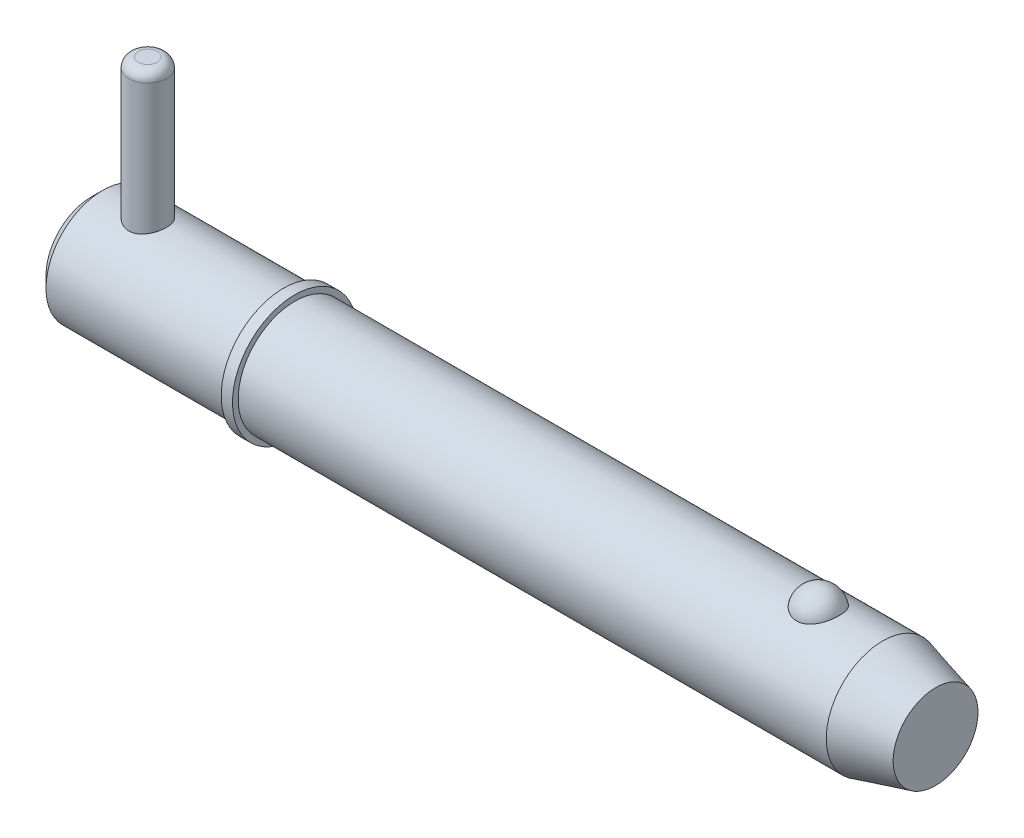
ISO-10303-21;
HEADER;
FILE_DESCRIPTION(('STEP AP214'),'2;1');
FILE_NAME('part.step','',(''),(''),'','','');
FILE_SCHEMA(('AUTOMOTIVE_DESIGN { 1 0 10303 214 1 1 1 1 }'));
ENDSEC;
DATA;
#1=APPLICATION_CONTEXT('core data for automotive mechanical design processes');
#2=APPLICATION_PROTOCOL_DEFINITION('international standard','automotive_design',2000,#1);
#3=PRODUCT_CONTEXT('',#1,'mechanical');
#4=PRODUCT('Part','Part','',(#3));
#5=PRODUCT_RELATED_PRODUCT_CATEGORY('part','',(#4));
#6=PRODUCT_DEFINITION_FORMATION('','',#4);
#7=PRODUCT_DEFINITION_CONTEXT('part definition',#1,'design');
#8=PRODUCT_DEFINITION('design','',#6,#7);
#9=PRODUCT_DEFINITION_SHAPE('','',#8);
#10=(LENGTH_UNIT() NAMED_UNIT(*) SI_UNIT(.MILLI.,.METRE.));
#11=(NAMED_UNIT(*) PLANE_ANGLE_UNIT() SI_UNIT($,.RADIAN.));
#12=(NAMED_UNIT(*) SI_UNIT($,.STERADIAN.) SOLID_ANGLE_UNIT());
#13=UNCERTAINTY_MEASURE_WITH_UNIT(LENGTH_MEASURE(1.E-05),#10,'distance_accuracy_value','');
#14=(GEOMETRIC_REPRESENTATION_CONTEXT(3) GLOBAL_UNCERTAINTY_ASSIGNED_CONTEXT((#13)) GLOBAL_UNIT_ASSIGNED_CONTEXT((#10,
#11,#12)) REPRESENTATION_CONTEXT('',''));
#15=CARTESIAN_POINT('',(0.,0.,0.));
#16=DIRECTION('',(0.,0.,1.));
#17=DIRECTION('',(1.,0.,0.));
#18=AXIS2_PLACEMENT_3D('',#15,#16,#17);
#19=CARTESIAN_POINT('',(7.14,24.605,0.));
#20=DIRECTION('',(0.,-1.,0.));
#21=DIRECTION('',(0.,0.,-1.));
#22=AXIS2_PLACEMENT_3D('',#19,#20,#21);
#23=CYLINDRICAL_SURFACE('',#22,2.38);
#24=CARTESIAN_POINT('',(7.14,-5.955,0.));
#25=DIRECTION('',(0.,1.,0.));
#26=DIRECTION('',(0.,0.,1.));
#27=AXIS2_PLACEMENT_3D('',#24,#25,#26);
#28=CIRCLE('',#27,2.38);
#29=CARTESIAN_POINT('',(7.14,-5.955,2.38));
#30=VERTEX_POINT('',#29);
#31=EDGE_CURVE('P0_E25',#30,#30,#28,.T.);
#32=ORIENTED_EDGE('',*,*,#31,.T.);
#33=EDGE_LOOP('',(#32));
#34=FACE_BOUND('',#33,.T.);
#35=CARTESIAN_POINT('',(7.14,23.415,0.));
#36=DIRECTION('',(0.,1.,0.));
#37=DIRECTION('',(0.,0.,1.));
#38=AXIS2_PLACEMENT_3D('',#35,#36,#37);
#39=CIRCLE('',#38,2.38);
#40=CARTESIAN_POINT('',(7.14,23.415,2.38));
#41=VERTEX_POINT('',#40);
#42=EDGE_CURVE('P0_E29',#41,#41,#39,.F.);
#43=ORIENTED_EDGE('',*,*,#42,.T.);
#44=EDGE_LOOP('',(#43));
#45=FACE_BOUND('',#44,.T.);
#46=ADVANCED_FACE('P0_F14',(#34,#45),#23,.T.);
#47=CARTESIAN_POINT('',(7.14,24.605,0.));
#48=DIRECTION('',(0.,1.,0.));
#49=DIRECTION('',(0.,0.,1.));
#50=AXIS2_PLACEMENT_3D('',#47,#48,#49);
#51=PLANE('',#50);
#52=CARTESIAN_POINT('',(7.14,24.605,0.));
#53=DIRECTION('',(0.,1.,0.));
#54=DIRECTION('',(0.,0.,1.));
#55=AXIS2_PLACEMENT_3D('',#52,#53,#54);
#56=CIRCLE('',#55,1.19);
#57=CARTESIAN_POINT('',(7.14,24.605,1.19));
#58=VERTEX_POINT('',#57);
#59=EDGE_CURVE('P0_E10',#58,#58,#56,.T.);
#60=ORIENTED_EDGE('',*,*,#59,.T.);
#61=EDGE_LOOP('',(#60));
#62=FACE_BOUND('',#61,.T.);
#63=ADVANCED_FACE('P0_F46',(#62),#51,.T.);
#64=CARTESIAN_POINT('',(7.14,-7.145,0.));
#65=DIRECTION('',(0.,1.,0.));
#66=DIRECTION('',(0.,0.,1.));
#67=AXIS2_PLACEMENT_3D('',#64,#65,#66);
#68=PLANE('',#67);
#69=CARTESIAN_POINT('',(7.14,-7.145,0.));
#70=DIRECTION('',(0.,1.,0.));
#71=DIRECTION('',(0.,0.,1.));
#72=AXIS2_PLACEMENT_3D('',#69,#70,#71);
#73=CIRCLE('',#72,1.19);
#74=CARTESIAN_POINT('',(7.14,-7.145,1.19));
#75=VERTEX_POINT('',#74);
#76=EDGE_CURVE('P0_E21',#75,#75,#73,.F.);
#77=ORIENTED_EDGE('',*,*,#76,.T.);
#78=EDGE_LOOP('',(#77));
#79=FACE_BOUND('',#78,.T.);
#80=ADVANCED_FACE('P0_F43',(#79),#68,.F.);
#81=CARTESIAN_POINT('',(7.14,-5.955,0.));
#82=DIRECTION('',(0.,1.,0.));
#83=DIRECTION('',(0.,0.,1.));
#84=AXIS2_PLACEMENT_3D('',#81,#82,#83);
#85=DEGENERATE_TOROIDAL_SURFACE('',#84,1.19,1.19,.T.);
#86=ORIENTED_EDGE('',*,*,#76,.F.);
#87=EDGE_LOOP('',(#86));
#88=FACE_BOUND('',#87,.T.);
#89=ORIENTED_EDGE('',*,*,#31,.F.);
#90=EDGE_LOOP('',(#89));
#91=FACE_BOUND('',#90,.T.);
#92=ADVANCED_FACE('P0_F38',(#88,#91),#85,.T.);
#93=CARTESIAN_POINT('',(7.14,23.415,0.));
#94=DIRECTION('',(0.,1.,0.));
#95=DIRECTION('',(0.,0.,1.));
#96=AXIS2_PLACEMENT_3D('',#93,#94,#95);
#97=DEGENERATE_TOROIDAL_SURFACE('',#96,1.19,1.19,.T.);
#98=ORIENTED_EDGE('',*,*,#42,.F.);
#99=EDGE_LOOP('',(#98));
#100=FACE_BOUND('',#99,.T.);
#101=ORIENTED_EDGE('',*,*,#59,.F.);
#102=EDGE_LOOP('',(#101));
#103=FACE_BOUND('',#102,.T.);
#104=ADVANCED_FACE('P0_F16',(#100,#103),#97,.T.);
#105=CLOSED_SHELL('',(#46,#63,#80,#92,#104));
#106=MANIFOLD_SOLID_BREP('P0_B1',#105);
#107=CARTESIAN_POINT('',(0.,0.,0.));
#108=DIRECTION('',(1.,0.,0.));
#109=DIRECTION('',(0.,0.,-1.));
#110=AXIS2_PLACEMENT_3D('',#107,#108,#109);
#111=CYLINDRICAL_SURFACE('',#110,7.145);
#112=CARTESIAN_POINT('',(99.9836242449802,0.,0.));
#113=DIRECTION('',(1.,0.,0.));
#114=DIRECTION('',(0.,0.,-1.));
#115=AXIS2_PLACEMENT_3D('',#112,#113,#114);
#116=CIRCLE('',#115,7.145);
#117=CARTESIAN_POINT('',(99.9836242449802,0.,-7.145));
#118=VERTEX_POINT('',#117);
#119=EDGE_CURVE('P1_E81',#118,#118,#116,.T.);
#120=ORIENTED_EDGE('',*,*,#119,.F.);
#121=EDGE_LOOP('',(#120));
#122=FACE_BOUND('',#121,.T.);
#123=CARTESIAN_POINT('',(25.7,0.,0.));
#124=DIRECTION('',(1.,0.,0.));
#125=DIRECTION('',(0.,0.,-1.));
#126=AXIS2_PLACEMENT_3D('',#123,#124,#125);
#127=CIRCLE('',#126,7.145);
#128=CARTESIAN_POINT('',(25.7,0.,-7.145));
#129=VERTEX_POINT('',#128);
#130=EDGE_CURVE('P1_E85',#129,#129,#127,.T.);
#131=ORIENTED_EDGE('',*,*,#130,.T.);
#132=EDGE_LOOP('',(#131));
#133=FACE_BOUND('',#132,.T.);
#134=CARTESIAN_POINT('',(91.8395037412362,6.60328629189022,2.72903557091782));
#135=CARTESIAN_POINT('',(91.6983158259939,6.60329644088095,2.72902496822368));
#136=CARTESIAN_POINT('',(91.5568832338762,6.60799490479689,2.71772840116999));
#137=CARTESIAN_POINT('',(91.2779557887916,6.62628236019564,2.67281935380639));
#138=CARTESIAN_POINT('',(91.1404726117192,6.63989534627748,2.63914664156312));
#139=CARTESIAN_POINT('',(90.8738894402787,6.67440775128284,2.55059642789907));
#140=CARTESIAN_POINT('',(90.7447683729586,6.69528793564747,2.49577486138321));
#141=CARTESIAN_POINT('',(90.4978694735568,6.74205585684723,2.36651799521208));
#142=CARTESIAN_POINT('',(90.3800865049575,6.76794130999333,2.29209163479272));
#143=CARTESIAN_POINT('',(90.1551671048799,6.82286177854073,2.12312937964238));
#144=CARTESIAN_POINT('',(90.0484405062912,6.85196655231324,2.02807107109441));
#145=CARTESIAN_POINT('',(89.8519181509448,6.90970232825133,1.82167822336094));
#146=CARTESIAN_POINT('',(89.7621276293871,6.93833318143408,1.71033867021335));
#147=CARTESIAN_POINT('',(89.5976670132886,6.9935167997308,1.46891951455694));
#148=CARTESIAN_POINT('',(89.523844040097,7.01992110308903,1.33822781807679));
#149=CARTESIAN_POINT('',(89.3980884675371,7.06643385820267,1.0656656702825));
#150=CARTESIAN_POINT('',(89.3461573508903,7.08654188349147,0.923794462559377));
#151=CARTESIAN_POINT('',(89.2647323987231,7.11862399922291,0.630993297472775));
#152=CARTESIAN_POINT('',(89.2355167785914,7.13049704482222,0.479974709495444));
#153=CARTESIAN_POINT('',(89.2011742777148,7.14449484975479,0.174782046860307));
#154=CARTESIAN_POINT('',(89.1960466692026,7.14661990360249,0.0206080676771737));
#155=CARTESIAN_POINT('',(89.209938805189,7.14092465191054,-0.285506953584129));
#156=CARTESIAN_POINT('',(89.2288101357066,7.1331654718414,-0.437455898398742));
#157=CARTESIAN_POINT('',(89.2900622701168,7.10859076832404,-0.735778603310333));
#158=CARTESIAN_POINT('',(89.3324435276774,7.0917750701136,-0.882152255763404));
#159=CARTESIAN_POINT('',(89.4399346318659,7.05076716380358,-1.16543149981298));
#160=CARTESIAN_POINT('',(89.5050759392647,7.02656475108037,-1.30232366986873));
#161=CARTESIAN_POINT('',(89.6567597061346,6.97329145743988,-1.56265907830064));
#162=CARTESIAN_POINT('',(89.743303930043,6.94422017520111,-1.68610120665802));
#163=CARTESIAN_POINT('',(89.9364654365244,6.88415108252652,-1.91671004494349));
#164=CARTESIAN_POINT('',(90.0431807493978,6.85314438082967,-2.02379244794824));
#165=CARTESIAN_POINT('',(90.2739740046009,6.79282069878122,-2.21787433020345));
#166=CARTESIAN_POINT('',(90.3980505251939,6.76350358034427,-2.30487545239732));
#167=CARTESIAN_POINT('',(90.6576784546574,6.7106058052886,-2.45458647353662));
#168=CARTESIAN_POINT('',(90.7929387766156,6.68691885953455,-2.5177624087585));
#169=CARTESIAN_POINT('',(91.0732778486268,6.64741247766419,-2.62030218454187));
#170=CARTESIAN_POINT('',(91.218352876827,6.63159007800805,-2.65967499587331));
#171=CARTESIAN_POINT('',(91.5063475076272,6.61038594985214,-2.71193301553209));
#172=CARTESIAN_POINT('',(91.6490080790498,6.60451880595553,-2.72605165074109));
#173=CARTESIAN_POINT('',(91.9348004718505,6.60240611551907,-2.73116688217));
#174=CARTESIAN_POINT('',(92.0779321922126,6.60615862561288,-2.72216814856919));
#175=CARTESIAN_POINT('',(92.3558486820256,6.6225609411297,-2.68200435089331));
#176=CARTESIAN_POINT('',(92.4907542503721,6.63492533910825,-2.65154998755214));
#177=CARTESIAN_POINT('',(92.75332009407,6.66687445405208,-2.57015684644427));
#178=CARTESIAN_POINT('',(92.8809797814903,6.68645975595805,-2.51921640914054));
#179=CARTESIAN_POINT('',(93.1285777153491,6.73127274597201,-2.39693610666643));
#180=CARTESIAN_POINT('',(93.2482878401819,6.7566138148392,-2.32517694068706));
#181=CARTESIAN_POINT('',(93.4741592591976,6.8100600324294,-2.1636381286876));
#182=CARTESIAN_POINT('',(93.580317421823,6.83816581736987,-2.07385432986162));
#183=CARTESIAN_POINT('',(93.7818620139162,6.89580469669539,-1.87357235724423));
#184=CARTESIAN_POINT('',(93.876440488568,6.92533863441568,-1.76226074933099));
#185=CARTESIAN_POINT('',(94.0463329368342,6.98139526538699,-1.52511696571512));
#186=CARTESIAN_POINT('',(94.1216434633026,7.0079174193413,-1.39928219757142));
#187=CARTESIAN_POINT('',(94.253595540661,7.05607625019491,-1.1321597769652));
#188=CARTESIAN_POINT('',(94.3095688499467,7.07753119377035,-0.990508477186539));
#189=CARTESIAN_POINT('',(94.3982965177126,7.11222355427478,-0.699154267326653));
#190=CARTESIAN_POINT('',(94.4310506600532,7.12546089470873,-0.549451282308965));
#191=CARTESIAN_POINT('',(94.4726899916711,7.1423758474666,-0.246120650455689));
#192=CARTESIAN_POINT('',(94.481558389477,7.14604673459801,-0.0924903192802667));
#193=CARTESIAN_POINT('',(94.4751940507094,7.14343510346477,0.214181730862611));
#194=CARTESIAN_POINT('',(94.4599618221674,7.13715279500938,0.367223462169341));
#195=CARTESIAN_POINT('',(94.4058451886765,7.11532948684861,0.667595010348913));
#196=CARTESIAN_POINT('',(94.3670776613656,7.09983424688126,0.814949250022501));
#197=CARTESIAN_POINT('',(94.2667700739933,7.06119140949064,1.10063221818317));
#198=CARTESIAN_POINT('',(94.2052284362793,7.03804328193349,1.23896032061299));
#199=CARTESIAN_POINT('',(94.0602071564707,6.98632429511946,1.5035230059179));
#200=CARTESIAN_POINT('',(93.9766067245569,6.95772382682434,1.62968561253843));
#201=CARTESIAN_POINT('',(93.7893804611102,6.89823072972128,1.865543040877));
#202=CARTESIAN_POINT('',(93.6857557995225,6.86733823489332,1.9752388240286));
#203=CARTESIAN_POINT('',(93.4610769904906,6.80676456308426,2.17482293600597));
#204=CARTESIAN_POINT('',(93.3400673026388,6.77708053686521,2.26476035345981));
#205=CARTESIAN_POINT('',(93.0833408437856,6.7223050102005,2.42252989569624));
#206=CARTESIAN_POINT('',(92.94761851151,6.69721525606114,2.49035362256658));
#207=CARTESIAN_POINT('',(92.6704022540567,6.65552591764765,2.59967646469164));
#208=CARTESIAN_POINT('',(92.5292810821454,6.63865794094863,2.64202017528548));
#209=CARTESIAN_POINT('',(92.2414448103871,6.61425039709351,2.70255841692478));
#210=CARTESIAN_POINT('',(92.0947480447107,6.60668259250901,2.720826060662));
#211=CARTESIAN_POINT('',(91.9116799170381,6.60358754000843,2.72830331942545));
#212=CARTESIAN_POINT('',(91.8755998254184,6.60328369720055,2.72903828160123));
#213=CARTESIAN_POINT('',(91.8395037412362,6.60328629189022,2.72903557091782));
#214=B_SPLINE_CURVE_WITH_KNOTS('',3,(#134,#135,#136,#137,#138,#139,#140,#141,#142,#143,#144,
#145,#146,#147,#148,#149,#150,#151,#152,#153,#154,#155,#156,#157,#158,#159,#160,#161,#162,#163,
#164,#165,#166,#167,#168,#169,#170,#171,#172,#173,#174,#175,#176,#177,#178,#179,#180,#181,#182,
#183,#184,#185,#186,#187,#188,#189,#190,#191,#192,#193,#194,#195,#196,#197,#198,#199,#200,#201,
#202,#203,#204,#205,#206,#207,#208,#209,#210,#211,#212,#213),.UNSPECIFIED.,.T.,.F.,(4,2,2,2,2,2,
2,2,2,2,2,2,2,2,2,2,2,2,2,2,2,2,2,2,2,2,2,2,2,2,2,2,2,2,2,2,2,2,2,4),(0.,0.423468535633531,
0.848081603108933,1.27157926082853,1.69488414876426,2.13051395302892,2.56627819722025,
3.0213670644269,3.47648674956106,3.93709649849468,4.39769233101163,4.85545355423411,
5.31322361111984,5.77162895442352,6.23007210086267,6.69080337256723,7.15149693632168,
7.60264329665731,8.05361952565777,8.48189729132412,8.91008854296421,9.32472524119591,
9.73939553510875,10.1630783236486,10.5868588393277,11.0319070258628,11.4770347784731,
11.9362874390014,12.3955443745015,12.855124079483,13.3146940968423,13.7720003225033,
14.2293382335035,14.6892343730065,15.1491036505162,15.6078171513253,16.0667046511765,
16.5093965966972,16.9507410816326,17.059004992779),.UNSPECIFIED.);
#215=CARTESIAN_POINT('',(91.8395037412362,6.60328629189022,2.72903557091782));
#216=VERTEX_POINT('',#215);
#217=EDGE_CURVE('P1_E35',#216,#216,#214,.T.);
#218=ORIENTED_EDGE('',*,*,#217,.T.);
#219=EDGE_LOOP('',(#218));
#220=FACE_BOUND('',#219,.T.);
#221=ADVANCED_FACE('P1_F13',(#122,#133,#220),#111,.T.);
#222=CARTESIAN_POINT('',(0.,0.,0.));
#223=DIRECTION('',(-1.,0.,0.));
#224=DIRECTION('',(0.,0.,1.));
#225=AXIS2_PLACEMENT_3D('',#222,#223,#224);
#226=PLANE('',#225);
#227=CARTESIAN_POINT('',(0.,0.,0.));
#228=DIRECTION('',(1.,0.,0.));
#229=DIRECTION('',(0.,0.,-1.));
#230=AXIS2_PLACEMENT_3D('',#227,#228,#229);
#231=CIRCLE('',#230,5.716);
#232=CARTESIAN_POINT('',(0.,0.,-5.716));
#233=VERTEX_POINT('',#232);
#234=EDGE_CURVE('P1_E9',#233,#233,#231,.T.);
#235=ORIENTED_EDGE('',*,*,#234,.F.);
#236=EDGE_LOOP('',(#235));
#237=FACE_BOUND('',#236,.T.);
#238=ADVANCED_FACE('P1_F15',(#237),#226,.T.);
#239=CARTESIAN_POINT('',(1.42899999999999,0.,0.));
#240=DIRECTION('',(1.,0.,0.));
#241=DIRECTION('',(0.,0.,-1.));
#242=AXIS2_PLACEMENT_3D('',#239,#240,#241);
#243=CONICAL_SURFACE('',#242,7.145,0.78539816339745);
#244=ORIENTED_EDGE('',*,*,#234,.T.);
#245=EDGE_LOOP('',(#244));
#246=FACE_BOUND('',#245,.T.);
#247=CARTESIAN_POINT('',(1.42899999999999,0.,0.));
#248=DIRECTION('',(1.,0.,0.));
#249=DIRECTION('',(0.,0.,-1.));
#250=AXIS2_PLACEMENT_3D('',#247,#248,#249);
#251=CIRCLE('',#250,7.145);
#252=CARTESIAN_POINT('',(1.42899999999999,0.,-7.145));
#253=VERTEX_POINT('',#252);
#254=EDGE_CURVE('P1_E26',#253,#253,#251,.T.);
#255=ORIENTED_EDGE('',*,*,#254,.F.);
#256=EDGE_LOOP('',(#255));
#257=FACE_BOUND('',#256,.T.);
#258=ADVANCED_FACE('P1_F77',(#246,#257),#243,.T.);
#259=CARTESIAN_POINT('',(0.,0.,0.));
#260=DIRECTION('',(1.,0.,0.));
#261=DIRECTION('',(0.,0.,-1.));
#262=AXIS2_PLACEMENT_3D('',#259,#260,#261);
#263=CYLINDRICAL_SURFACE('',#262,7.145);
#264=CARTESIAN_POINT('',(7.14,-6.73695962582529,2.38));
#265=CARTESIAN_POINT('',(7.01035997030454,-6.73695921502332,2.38000059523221));
#266=CARTESIAN_POINT('',(6.88072348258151,-6.74074253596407,2.36937183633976));
#267=CARTESIAN_POINT('',(6.62529075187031,-6.75538853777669,2.32728080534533));
#268=CARTESIAN_POINT('',(6.49949514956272,-6.76625239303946,2.29581507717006));
#269=CARTESIAN_POINT('',(6.2554858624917,-6.79369535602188,2.21327763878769));
#270=CARTESIAN_POINT('',(6.13725786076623,-6.81026326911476,2.16224430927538));
#271=CARTESIAN_POINT('',(5.91100349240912,-6.84723128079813,2.04215132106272));
#272=CARTESIAN_POINT('',(5.80297937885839,-6.86763222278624,1.97308769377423));
#273=CARTESIAN_POINT('',(5.59597854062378,-6.91086152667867,1.81600414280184));
#274=CARTESIAN_POINT('',(5.49745861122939,-6.93375032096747,1.72739874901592));
#275=CARTESIAN_POINT('',(5.31636508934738,-6.97886546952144,1.53499636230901));
#276=CARTESIAN_POINT('',(5.23379405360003,-7.00109171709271,1.43119693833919));
#277=CARTESIAN_POINT('',(5.08487013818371,-7.04307708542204,1.20801318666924));
#278=CARTESIAN_POINT('',(5.01899578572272,-7.06275685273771,1.08829330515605));
#279=CARTESIAN_POINT('',(4.90850130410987,-7.09671988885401,0.838703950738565));
#280=CARTESIAN_POINT('',(4.86387545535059,-7.11100460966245,0.70883722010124));
#281=CARTESIAN_POINT('',(4.79869354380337,-7.13213998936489,0.44742990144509));
#282=CARTESIAN_POINT('',(4.77735497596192,-7.13923172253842,0.316104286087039));
#283=CARTESIAN_POINT('',(4.75686536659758,-7.14603777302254,0.0515578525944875));
#284=CARTESIAN_POINT('',(4.75770861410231,-7.14575398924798,-0.0816624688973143));
#285=CARTESIAN_POINT('',(4.78106216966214,-7.13800438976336,-0.340678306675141));
#286=CARTESIAN_POINT('',(4.80272255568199,-7.13082030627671,-0.466560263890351));
#287=CARTESIAN_POINT('',(4.86569013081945,-7.11043095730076,-0.712788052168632));
#288=CARTESIAN_POINT('',(4.90699865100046,-7.09722528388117,-0.833133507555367));
#289=CARTESIAN_POINT('',(5.00858673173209,-7.06591754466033,-1.06673173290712));
#290=CARTESIAN_POINT('',(5.06910834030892,-7.0477534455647,-1.17987058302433));
#291=CARTESIAN_POINT('',(5.20720514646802,-7.00841977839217,-1.39463797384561));
#292=CARTESIAN_POINT('',(5.28478508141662,-6.987249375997,-1.49626330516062));
#293=CARTESIAN_POINT('',(5.4590800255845,-6.94296010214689,-1.69017445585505));
#294=CARTESIAN_POINT('',(5.55652324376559,-6.91979641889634,-1.78179645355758));
#295=CARTESIAN_POINT('',(5.76558873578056,-6.87497076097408,-1.94761348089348));
#296=CARTESIAN_POINT('',(5.87721318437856,-6.85330901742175,-2.02180583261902));
#297=CARTESIAN_POINT('',(6.11357367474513,-6.81369485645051,-2.15157488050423));
#298=CARTESIAN_POINT('',(6.23847358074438,-6.79579956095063,-2.20687188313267));
#299=CARTESIAN_POINT('',(6.49655785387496,-6.76640630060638,-2.29542443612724));
#300=CARTESIAN_POINT('',(6.62973872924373,-6.75490565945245,-2.32868920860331));
#301=CARTESIAN_POINT('',(6.89417536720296,-6.74020933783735,-2.37088225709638));
#302=CARTESIAN_POINT('',(7.02524746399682,-6.73666278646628,-2.38083959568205));
#303=CARTESIAN_POINT('',(7.28721035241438,-6.73729555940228,-2.37904974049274));
#304=CARTESIAN_POINT('',(7.41810117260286,-6.7414734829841,-2.36730648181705));
#305=CARTESIAN_POINT('',(7.67130717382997,-6.75673471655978,-2.32337336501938));
#306=CARTESIAN_POINT('',(7.79376251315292,-6.76757635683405,-2.29189834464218));
#307=CARTESIAN_POINT('',(8.03162917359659,-6.79467771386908,-2.21025275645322));
#308=CARTESIAN_POINT('',(8.14703924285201,-6.8109383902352,-2.16007887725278));
#309=CARTESIAN_POINT('',(8.37159169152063,-6.84768362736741,-2.04065289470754));
#310=CARTESIAN_POINT('',(8.48041962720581,-6.86828569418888,-1.97084668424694));
#311=CARTESIAN_POINT('',(8.68518919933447,-6.91116416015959,-1.8147657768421));
#312=CARTESIAN_POINT('',(8.78112702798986,-6.93344105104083,-1.72848623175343));
#313=CARTESIAN_POINT('',(8.96215574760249,-6.97845348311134,-1.53698616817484));
#314=CARTESIAN_POINT('',(9.04650427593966,-7.00115965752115,-1.43105491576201));
#315=CARTESIAN_POINT('',(9.19627592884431,-7.04341676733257,-1.20598377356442));
#316=CARTESIAN_POINT('',(9.26169972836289,-7.06296781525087,-1.08684435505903));
#317=CARTESIAN_POINT('',(9.37116617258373,-7.0966205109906,-0.83933303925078));
#318=CARTESIAN_POINT('',(9.41534821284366,-7.11075755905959,-0.711027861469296));
#319=CARTESIAN_POINT('',(9.48132660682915,-7.13214194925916,-0.448245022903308));
#320=CARTESIAN_POINT('',(9.50313102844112,-7.13939177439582,-0.313769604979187));
#321=CARTESIAN_POINT('',(9.5230098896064,-7.14599771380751,-0.049254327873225));
#322=CARTESIAN_POINT('',(9.52215013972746,-7.14570837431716,0.0806974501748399));
#323=CARTESIAN_POINT('',(9.49935359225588,-7.13814116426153,0.338518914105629));
#324=CARTESIAN_POINT('',(9.47741850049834,-7.13086385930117,0.466388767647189));
#325=CARTESIAN_POINT('',(9.4138005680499,-7.11026814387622,0.714400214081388));
#326=CARTESIAN_POINT('',(9.37243609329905,-7.09704726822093,0.834632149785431));
#327=CARTESIAN_POINT('',(9.27142829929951,-7.06592602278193,1.06649582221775));
#328=CARTESIAN_POINT('',(9.2117816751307,-7.04802480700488,1.1781259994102));
#329=CARTESIAN_POINT('',(9.07336776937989,-7.00856499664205,1.39411030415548));
#330=CARTESIAN_POINT('',(8.99397590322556,-6.98689577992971,1.49804368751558));
#331=CARTESIAN_POINT('',(8.81938810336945,-6.9426110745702,1.69146078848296));
#332=CARTESIAN_POINT('',(8.72418713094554,-6.91999528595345,1.78093988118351));
#333=CARTESIAN_POINT('',(8.51623540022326,-6.87531507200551,1.94646188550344));
#334=CARTESIAN_POINT('',(8.4029442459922,-6.85330672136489,2.02184316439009));
#335=CARTESIAN_POINT('',(8.16461714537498,-6.81342065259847,2.1524427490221));
#336=CARTESIAN_POINT('',(8.03958429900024,-6.7955418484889,2.20766635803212));
#337=CARTESIAN_POINT('',(7.78712566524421,-6.76686117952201,2.29403636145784));
#338=CARTESIAN_POINT('',(7.66006989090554,-6.75577342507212,2.32616709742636));
#339=CARTESIAN_POINT('',(7.40200728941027,-6.74082409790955,2.36914495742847));
#340=CARTESIAN_POINT('',(7.27100183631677,-6.73696004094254,2.37999939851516));
#341=CARTESIAN_POINT('',(7.14,-6.73695962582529,2.38));
#342=B_SPLINE_CURVE_WITH_KNOTS('',3,(#264,#265,#266,#267,#268,#269,#270,#271,#272,#273,#274,
#275,#276,#277,#278,#279,#280,#281,#282,#283,#284,#285,#286,#287,#288,#289,#290,#291,#292,#293,
#294,#295,#296,#297,#298,#299,#300,#301,#302,#303,#304,#305,#306,#307,#308,#309,#310,#311,#312,
#313,#314,#315,#316,#317,#318,#319,#320,#321,#322,#323,#324,#325,#326,#327,#328,#329,#330,#331,
#332,#333,#334,#335,#336,#337,#338,#339,#340,#341),.UNSPECIFIED.,.T.,.F.,(4,2,2,2,2,2,2,2,2,2,2,
2,2,2,2,2,2,2,2,2,2,2,2,2,2,2,2,2,2,2,2,2,2,2,2,2,2,2,4),(0.,0.388434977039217,
0.776934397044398,1.16467566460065,1.55250234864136,1.9540847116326,2.35573139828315,
2.76784120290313,3.17984001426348,3.57752248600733,3.97510257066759,4.35711073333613,
4.7391447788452,5.12619663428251,5.51335611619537,5.91871976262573,6.3241456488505,
6.73533623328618,7.14635459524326,7.53885245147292,7.93127914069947,8.31025106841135,
8.68929014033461,9.08033871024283,9.47150254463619,9.88145528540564,10.2913934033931,
10.6986033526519,11.1056664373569,11.4936225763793,11.8815473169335,12.2633262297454,
12.645174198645,13.0411187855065,13.437189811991,13.8487371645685,14.2601761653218,
14.6528265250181,15.0453418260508),.UNSPECIFIED.);
#343=CARTESIAN_POINT('',(7.14,-6.73695962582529,2.38));
#344=VERTEX_POINT('',#343);
#345=EDGE_CURVE('P1_E17',#344,#344,#342,.T.);
#346=ORIENTED_EDGE('',*,*,#345,.F.);
#347=EDGE_LOOP('',(#346));
#348=FACE_BOUND('',#347,.T.);
#349=CARTESIAN_POINT('',(7.14,6.73695962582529,2.38));
#350=CARTESIAN_POINT('',(7.26964002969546,6.73695921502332,2.38000059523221));
#351=CARTESIAN_POINT('',(7.39927651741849,6.74074253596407,2.36937183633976));
#352=CARTESIAN_POINT('',(7.65470924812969,6.75538853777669,2.32728080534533));
#353=CARTESIAN_POINT('',(7.78050485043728,6.76625239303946,2.29581507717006));
#354=CARTESIAN_POINT('',(8.02451413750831,6.79369535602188,2.21327763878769));
#355=CARTESIAN_POINT('',(8.14274213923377,6.81026326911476,2.16224430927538));
#356=CARTESIAN_POINT('',(8.36899650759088,6.84723128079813,2.04215132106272));
#357=CARTESIAN_POINT('',(8.47702062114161,6.86763222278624,1.97308769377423));
#358=CARTESIAN_POINT('',(8.68402145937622,6.91086152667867,1.81600414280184));
#359=CARTESIAN_POINT('',(8.78254138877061,6.93375032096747,1.72739874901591));
#360=CARTESIAN_POINT('',(8.96363491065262,6.97886546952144,1.53499636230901));
#361=CARTESIAN_POINT('',(9.04620594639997,7.00109171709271,1.43119693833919));
#362=CARTESIAN_POINT('',(9.19512986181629,7.04307708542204,1.20801318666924));
#363=CARTESIAN_POINT('',(9.26100421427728,7.06275685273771,1.08829330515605));
#364=CARTESIAN_POINT('',(9.37149869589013,7.09671988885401,0.838703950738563));
#365=CARTESIAN_POINT('',(9.41612454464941,7.11100460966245,0.708837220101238));
#366=CARTESIAN_POINT('',(9.48130645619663,7.13213998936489,0.447429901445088));
#367=CARTESIAN_POINT('',(9.50264502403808,7.13923172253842,0.316104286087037));
#368=CARTESIAN_POINT('',(9.52313463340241,7.14603777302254,0.0515578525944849));
#369=CARTESIAN_POINT('',(9.52229138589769,7.14575398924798,-0.0816624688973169));
#370=CARTESIAN_POINT('',(9.49893783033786,7.13800438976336,-0.340678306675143));
#371=CARTESIAN_POINT('',(9.47727744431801,7.13082030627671,-0.466560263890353));
#372=CARTESIAN_POINT('',(9.41430986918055,7.11043095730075,-0.712788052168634));
#373=CARTESIAN_POINT('',(9.37300134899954,7.09722528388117,-0.833133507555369));
#374=CARTESIAN_POINT('',(9.27141326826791,7.06591754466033,-1.06673173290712));
#375=CARTESIAN_POINT('',(9.21089165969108,7.0477534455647,-1.17987058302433));
#376=CARTESIAN_POINT('',(9.07279485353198,7.00841977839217,-1.39463797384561));
#377=CARTESIAN_POINT('',(8.99521491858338,6.987249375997,-1.49626330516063));
#378=CARTESIAN_POINT('',(8.82091997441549,6.94296010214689,-1.69017445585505));
#379=CARTESIAN_POINT('',(8.72347675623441,6.91979641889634,-1.78179645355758));
#380=CARTESIAN_POINT('',(8.51441126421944,6.87497076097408,-1.94761348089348));
#381=CARTESIAN_POINT('',(8.40278681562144,6.85330901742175,-2.02180583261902));
#382=CARTESIAN_POINT('',(8.16642632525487,6.81369485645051,-2.15157488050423));
#383=CARTESIAN_POINT('',(8.04152641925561,6.79579956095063,-2.20687188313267));
#384=CARTESIAN_POINT('',(7.78344214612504,6.76640630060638,-2.29542443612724));
#385=CARTESIAN_POINT('',(7.65026127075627,6.75490565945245,-2.32868920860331));
#386=CARTESIAN_POINT('',(7.38582463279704,6.74020933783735,-2.37088225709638));
#387=CARTESIAN_POINT('',(7.25475253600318,6.73666278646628,-2.38083959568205));
#388=CARTESIAN_POINT('',(6.99278964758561,6.73729555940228,-2.37904974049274));
#389=CARTESIAN_POINT('',(6.86189882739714,6.7414734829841,-2.36730648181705));
#390=CARTESIAN_POINT('',(6.60869282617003,6.75673471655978,-2.32337336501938));
#391=CARTESIAN_POINT('',(6.48623748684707,6.76757635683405,-2.29189834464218));
#392=CARTESIAN_POINT('',(6.2483708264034,6.79467771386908,-2.21025275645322));
#393=CARTESIAN_POINT('',(6.13296075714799,6.8109383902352,-2.16007887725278));
#394=CARTESIAN_POINT('',(5.90840830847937,6.84768362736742,-2.04065289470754));
#395=CARTESIAN_POINT('',(5.79958037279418,6.86828569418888,-1.97084668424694));
#396=CARTESIAN_POINT('',(5.59481080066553,6.91116416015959,-1.8147657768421));
#397=CARTESIAN_POINT('',(5.49887297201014,6.93344105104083,-1.72848623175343));
#398=CARTESIAN_POINT('',(5.31784425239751,6.97845348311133,-1.53698616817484));
#399=CARTESIAN_POINT('',(5.23349572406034,7.00115965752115,-1.43105491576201));
#400=CARTESIAN_POINT('',(5.08372407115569,7.04341676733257,-1.20598377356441));
#401=CARTESIAN_POINT('',(5.01830027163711,7.06296781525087,-1.08684435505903));
#402=CARTESIAN_POINT('',(4.90883382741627,7.0966205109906,-0.839333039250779));
#403=CARTESIAN_POINT('',(4.86465178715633,7.11075755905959,-0.711027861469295));
#404=CARTESIAN_POINT('',(4.79867339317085,7.13214194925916,-0.448245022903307));
#405=CARTESIAN_POINT('',(4.77686897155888,7.13939177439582,-0.313769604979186));
#406=CARTESIAN_POINT('',(4.7569901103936,7.14599771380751,-0.0492543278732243));
#407=CARTESIAN_POINT('',(4.75784986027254,7.14570837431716,0.0806974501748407));
#408=CARTESIAN_POINT('',(4.78064640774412,7.13814116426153,0.33851891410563));
#409=CARTESIAN_POINT('',(4.80258149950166,7.13086385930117,0.46638876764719));
#410=CARTESIAN_POINT('',(4.8661994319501,7.11026814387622,0.714400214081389));
#411=CARTESIAN_POINT('',(4.90756390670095,7.09704726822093,0.834632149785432));
#412=CARTESIAN_POINT('',(5.00857170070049,7.06592602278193,1.06649582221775));
#413=CARTESIAN_POINT('',(5.0682183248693,7.04802480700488,1.1781259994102));
#414=CARTESIAN_POINT('',(5.20663223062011,7.00856499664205,1.39411030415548));
#415=CARTESIAN_POINT('',(5.28602409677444,6.98689577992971,1.49804368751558));
#416=CARTESIAN_POINT('',(5.46061189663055,6.9426110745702,1.69146078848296));
#417=CARTESIAN_POINT('',(5.55581286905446,6.91999528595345,1.78093988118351));
#418=CARTESIAN_POINT('',(5.76376459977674,6.87531507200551,1.94646188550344));
#419=CARTESIAN_POINT('',(5.8770557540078,6.85330672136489,2.02184316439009));
#420=CARTESIAN_POINT('',(6.11538285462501,6.81342065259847,2.1524427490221));
#421=CARTESIAN_POINT('',(6.24041570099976,6.7955418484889,2.20766635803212));
#422=CARTESIAN_POINT('',(6.4928743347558,6.76686117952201,2.29403636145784));
#423=CARTESIAN_POINT('',(6.61993010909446,6.75577342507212,2.32616709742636));
#424=CARTESIAN_POINT('',(6.87799271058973,6.74082409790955,2.36914495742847));
#425=CARTESIAN_POINT('',(7.00899816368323,6.73696004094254,2.37999939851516));
#426=CARTESIAN_POINT('',(7.14,6.73695962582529,2.38));
#427=B_SPLINE_CURVE_WITH_KNOTS('',3,(#349,#350,#351,#352,#353,#354,#355,#356,#357,#358,#359,
#360,#361,#362,#363,#364,#365,#366,#367,#368,#369,#370,#371,#372,#373,#374,#375,#376,#377,#378,
#379,#380,#381,#382,#383,#384,#385,#386,#387,#388,#389,#390,#391,#392,#393,#394,#395,#396,#397,
#398,#399,#400,#401,#402,#403,#404,#405,#406,#407,#408,#409,#410,#411,#412,#413,#414,#415,#416,
#417,#418,#419,#420,#421,#422,#423,#424,#425,#426),.UNSPECIFIED.,.T.,.F.,(4,2,2,2,2,2,2,2,2,2,2,
2,2,2,2,2,2,2,2,2,2,2,2,2,2,2,2,2,2,2,2,2,2,2,2,2,2,2,4),(0.,0.388434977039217,
0.776934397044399,1.16467566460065,1.55250234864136,1.9540847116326,2.35573139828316,
2.76784120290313,3.17984001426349,3.57752248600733,3.97510257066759,4.35711073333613,
4.73914477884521,5.12619663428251,5.51335611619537,5.91871976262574,6.3241456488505,
6.73533623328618,7.14635459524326,7.53885245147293,7.93127914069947,8.31025106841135,
8.68929014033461,9.08033871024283,9.47150254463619,9.88145528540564,10.2913934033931,
10.6986033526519,11.1056664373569,11.4936225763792,11.8815473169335,12.2633262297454,
12.645174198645,13.0411187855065,13.437189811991,13.8487371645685,14.2601761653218,
14.6528265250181,15.0453418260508),.UNSPECIFIED.);
#428=CARTESIAN_POINT('',(7.14,6.73695962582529,2.38));
#429=VERTEX_POINT('',#428);
#430=EDGE_CURVE('P1_E43',#429,#429,#427,.T.);
#431=ORIENTED_EDGE('',*,*,#430,.F.);
#432=EDGE_LOOP('',(#431));
#433=FACE_BOUND('',#432,.T.);
#434=ORIENTED_EDGE('',*,*,#254,.T.);
#435=EDGE_LOOP('',(#434));
#436=FACE_BOUND('',#435,.T.);
#437=CARTESIAN_POINT('',(24.271,0.,0.));
#438=DIRECTION('',(1.,0.,0.));
#439=DIRECTION('',(0.,0.,-1.));
#440=AXIS2_PLACEMENT_3D('',#437,#438,#439);
#441=CIRCLE('',#440,7.145);
#442=CARTESIAN_POINT('',(24.271,0.,-7.145));
#443=VERTEX_POINT('',#442);
#444=EDGE_CURVE('P1_E31',#443,#443,#441,.T.);
#445=ORIENTED_EDGE('',*,*,#444,.F.);
#446=EDGE_LOOP('',(#445));
#447=FACE_BOUND('',#446,.T.);
#448=ADVANCED_FACE('P1_F103',(#348,#433,#436,#447),#263,.T.);
#449=CARTESIAN_POINT('',(24.271,7.145,0.));
#450=DIRECTION('',(-1.,0.,0.));
#451=DIRECTION('',(0.,0.,1.));
#452=AXIS2_PLACEMENT_3D('',#449,#450,#451);
#453=PLANE('',#452);
#454=ORIENTED_EDGE('',*,*,#444,.T.);
#455=EDGE_LOOP('',(#454));
#456=FACE_BOUND('',#455,.T.);
#457=CARTESIAN_POINT('',(24.271,0.,0.));
#458=DIRECTION('',(1.,0.,0.));
#459=DIRECTION('',(0.,0.,-1.));
#460=AXIS2_PLACEMENT_3D('',#457,#458,#459);
#461=CIRCLE('',#460,7.8595);
#462=CARTESIAN_POINT('',(24.271,0.,-7.8595));
#463=VERTEX_POINT('',#462);
#464=EDGE_CURVE('P1_E91',#463,#463,#461,.T.);
#465=ORIENTED_EDGE('',*,*,#464,.F.);
#466=EDGE_LOOP('',(#465));
#467=FACE_BOUND('',#466,.T.);
#468=ADVANCED_FACE('P1_F100',(#456,#467),#453,.T.);
#469=CARTESIAN_POINT('',(0.,0.,0.));
#470=DIRECTION('',(1.,0.,0.));
#471=DIRECTION('',(0.,0.,-1.));
#472=AXIS2_PLACEMENT_3D('',#469,#470,#471);
#473=CYLINDRICAL_SURFACE('',#472,7.8595);
#474=ORIENTED_EDGE('',*,*,#464,.T.);
#475=EDGE_LOOP('',(#474));
#476=FACE_BOUND('',#475,.T.);
#477=CARTESIAN_POINT('',(25.7,0.,0.));
#478=DIRECTION('',(1.,0.,0.));
#479=DIRECTION('',(0.,0.,-1.));
#480=AXIS2_PLACEMENT_3D('',#477,#478,#479);
#481=CIRCLE('',#480,7.8595);
#482=CARTESIAN_POINT('',(25.7,0.,-7.8595));
#483=VERTEX_POINT('',#482);
#484=EDGE_CURVE('P1_E88',#483,#483,#481,.T.);
#485=ORIENTED_EDGE('',*,*,#484,.F.);
#486=EDGE_LOOP('',(#485));
#487=FACE_BOUND('',#486,.T.);
#488=ADVANCED_FACE('P1_F68',(#476,#487),#473,.T.);
#489=CARTESIAN_POINT('',(25.7,7.8595,0.));
#490=DIRECTION('',(1.,0.,0.));
#491=DIRECTION('',(0.,0.,-1.));
#492=AXIS2_PLACEMENT_3D('',#489,#490,#491);
#493=PLANE('',#492);
#494=ORIENTED_EDGE('',*,*,#484,.T.);
#495=EDGE_LOOP('',(#494));
#496=FACE_BOUND('',#495,.T.);
#497=ORIENTED_EDGE('',*,*,#130,.F.);
#498=EDGE_LOOP('',(#497));
#499=FACE_BOUND('',#498,.T.);
#500=ADVANCED_FACE('P1_F62',(#496,#499),#493,.T.);
#501=CARTESIAN_POINT('',(106.65,0.,0.));
#502=DIRECTION('',(-1.,0.,0.));
#503=DIRECTION('',(0.,0.,1.));
#504=AXIS2_PLACEMENT_3D('',#501,#502,#503);
#505=CONICAL_SURFACE('',#504,5.35875000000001,0.26179938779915);
#506=ORIENTED_EDGE('',*,*,#119,.T.);
#507=EDGE_LOOP('',(#506));
#508=FACE_BOUND('',#507,.T.);
#509=CARTESIAN_POINT('',(106.65,0.,0.));
#510=DIRECTION('',(1.,0.,0.));
#511=DIRECTION('',(0.,0.,-1.));
#512=AXIS2_PLACEMENT_3D('',#509,#510,#511);
#513=CIRCLE('',#512,5.35875000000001);
#514=CARTESIAN_POINT('',(106.65,0.,-5.35875000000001));
#515=VERTEX_POINT('',#514);
#516=EDGE_CURVE('P1_E42',#515,#515,#513,.T.);
#517=ORIENTED_EDGE('',*,*,#516,.F.);
#518=EDGE_LOOP('',(#517));
#519=FACE_BOUND('',#518,.T.);
#520=ADVANCED_FACE('P1_F59',(#508,#519),#505,.T.);
#521=CARTESIAN_POINT('',(106.65,5.35875000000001,0.));
#522=DIRECTION('',(1.,0.,0.));
#523=DIRECTION('',(0.,0.,-1.));
#524=AXIS2_PLACEMENT_3D('',#521,#522,#523);
#525=PLANE('',#524);
#526=ORIENTED_EDGE('',*,*,#516,.T.);
#527=EDGE_LOOP('',(#526));
#528=FACE_BOUND('',#527,.T.);
#529=ADVANCED_FACE('P1_F55',(#528),#525,.T.);
#530=CARTESIAN_POINT('',(91.8395037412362,6.4305,0.));
#531=DIRECTION('',(-1.,0.,0.));
#532=DIRECTION('',(0.,-1.,0.));
#533=AXIS2_PLACEMENT_3D('',#530,#531,#532);
#534=SPHERICAL_SURFACE('',#533,2.73449999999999);
#535=ORIENTED_EDGE('',*,*,#217,.F.);
#536=EDGE_LOOP('',(#535));
#537=FACE_BOUND('',#536,.T.);
#538=ADVANCED_FACE('P1_F50',(#537),#534,.T.);
#539=CARTESIAN_POINT('',(7.14,-7.8595,0.));
#540=DIRECTION('',(0.,1.,0.));
#541=DIRECTION('',(0.,0.,1.));
#542=AXIS2_PLACEMENT_3D('',#539,#540,#541);
#543=CYLINDRICAL_SURFACE('',#542,2.38);
#544=ORIENTED_EDGE('',*,*,#345,.T.);
#545=EDGE_LOOP('',(#544));
#546=FACE_BOUND('',#545,.T.);
#547=ORIENTED_EDGE('',*,*,#430,.T.);
#548=EDGE_LOOP('',(#547));
#549=FACE_BOUND('',#548,.T.);
#550=ADVANCED_FACE('P1_F54',(#546,#549),#543,.F.);
#551=CLOSED_SHELL('',(#221,#238,#258,#448,#468,#488,#500,#520,#529,#538,#550));
#552=MANIFOLD_SOLID_BREP('P1_B1',#551);
#553=ADVANCED_BREP_SHAPE_REPRESENTATION('',(#18,#106,#552),#14);
#554=SHAPE_DEFINITION_REPRESENTATION(#9,#553);
ENDSEC;
END-ISO-10303-21;
